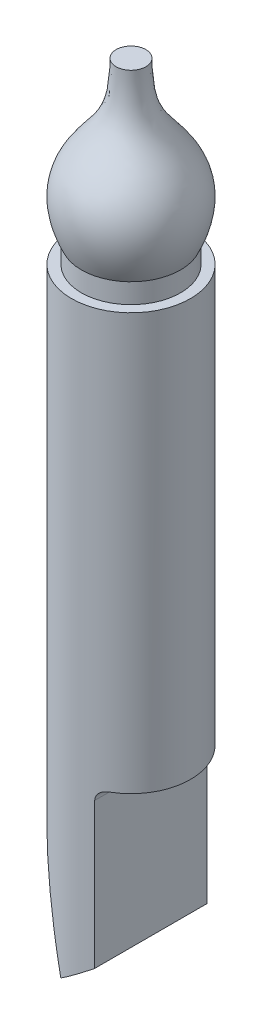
from build123d import *

# Parameters (mm, degrees)
CUT_EXTRUDE_1_DEPTH      = 40.230090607
CUT_EXTRUDE_1_DEPTH_BACK = 40.230090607


with BuildPart() as part:
    # Sketch 1 → Revolve 1 (revolve)
    with BuildSketch(Plane.XY, mode=Mode.PRIVATE) as revolve_1_sk:
        with BuildLine():
            Line((0, 0), (3, 0))
            Line((3, 0), (3, 30))
            Line((3, 30), (2.5, 30))
            Line((2.5, 30), (2.5, 31))
            add(Edge.make_bspline(
                [(0.75, 39), (0.75, 36.994911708), (1.623043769, 35.871683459), (3.622166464, 33.362125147), (2.5, 31)],
                knots=[0, 0, 0, 0, 0.491713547, 1, 1, 1, 1], degree=3))
            Line((0.75, 39), (0, 39))
            Line((0, 39), (0, 0))
        make_face()
    revolve(revolve_1_sk.sketch.rotate(Axis((0, 39, 0), (0, -1, 0)), 90), axis=Axis((0, 39, 0), (0, -1, 0)))

    # Sketch 2 → Cut-Extrude 1 (cut, two sides: drawn at the far end of the back side and taken through both)
    with BuildSketch(Plane.XY.offset(-CUT_EXTRUDE_1_DEPTH_BACK)):
        with BuildLine():
            Line((1, 1.162468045), (-0.6, 0))
            Line((-0.6, 0), (-0.6, -0.821238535))
            Line((-0.6, -0.821238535), (4.455335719, -0.821238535))
            Line((4.455335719, -0.821238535), (4.455335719, 9))
            Line((4.455335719, 9), (3, 9))
            Line((3, 9), (1.5, 9))
            ThreePointArc((1.5, 9), (1.146446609, 8.853553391), (1, 8.5))
            Line((1, 8.5), (1, 1.162468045))
        make_face()
        Polygon((-0.6, -0.821238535), (-0.6, 0), (-3, 8.956921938), (-4.63163299, 8.956921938), (-4.63163299, -0.821238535), align=None)
    extrude(amount=CUT_EXTRUDE_1_DEPTH + CUT_EXTRUDE_1_DEPTH_BACK, mode=Mode.SUBTRACT)


solid = part.part
